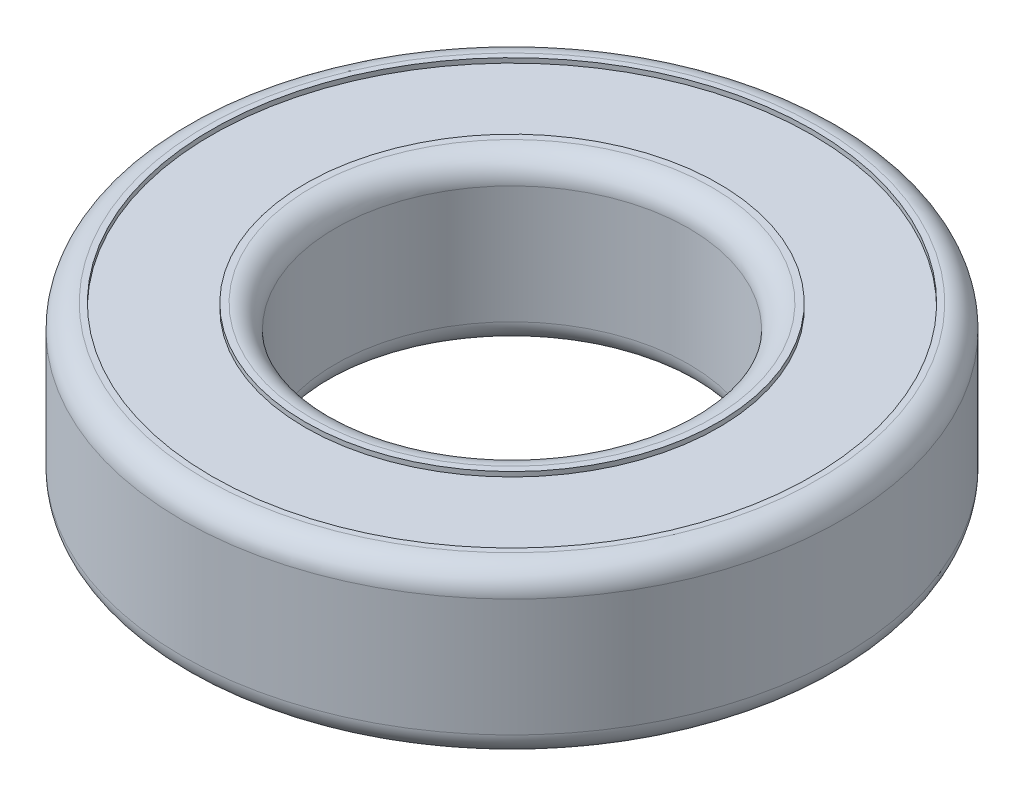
ISO-10303-21;
HEADER;
FILE_DESCRIPTION(('STEP AP214'),'2;1');
FILE_NAME('part.step','',(''),(''),'','','');
FILE_SCHEMA(('AUTOMOTIVE_DESIGN { 1 0 10303 214 1 1 1 1 }'));
ENDSEC;
DATA;
#1=APPLICATION_CONTEXT('core data for automotive mechanical design processes');
#2=APPLICATION_PROTOCOL_DEFINITION('international standard','automotive_design',2000,#1);
#3=PRODUCT_CONTEXT('',#1,'mechanical');
#4=PRODUCT('Part','Part','',(#3));
#5=PRODUCT_RELATED_PRODUCT_CATEGORY('part','',(#4));
#6=PRODUCT_DEFINITION_FORMATION('','',#4);
#7=PRODUCT_DEFINITION_CONTEXT('part definition',#1,'design');
#8=PRODUCT_DEFINITION('design','',#6,#7);
#9=PRODUCT_DEFINITION_SHAPE('','',#8);
#10=(LENGTH_UNIT() NAMED_UNIT(*) SI_UNIT(.MILLI.,.METRE.));
#11=(NAMED_UNIT(*) PLANE_ANGLE_UNIT() SI_UNIT($,.RADIAN.));
#12=(NAMED_UNIT(*) SI_UNIT($,.STERADIAN.) SOLID_ANGLE_UNIT());
#13=UNCERTAINTY_MEASURE_WITH_UNIT(LENGTH_MEASURE(1.E-05),#10,'distance_accuracy_value','');
#14=(GEOMETRIC_REPRESENTATION_CONTEXT(3) GLOBAL_UNCERTAINTY_ASSIGNED_CONTEXT((#13)) GLOBAL_UNIT_ASSIGNED_CONTEXT((#10,
#11,#12)) REPRESENTATION_CONTEXT('',''));
#15=CARTESIAN_POINT('',(0.,0.,0.));
#16=DIRECTION('',(0.,0.,1.));
#17=DIRECTION('',(1.,0.,0.));
#18=AXIS2_PLACEMENT_3D('',#15,#16,#17);
#19=CARTESIAN_POINT('',(-13.,-3.5,0.));
#20=DIRECTION('',(0.,1.,0.));
#21=DIRECTION('',(0.,0.,1.));
#22=AXIS2_PLACEMENT_3D('',#19,#20,#21);
#23=PLANE('',#22);
#24=CARTESIAN_POINT('',(0.,-3.5,0.));
#25=DIRECTION('',(0.,-1.,0.));
#26=DIRECTION('',(0.,0.,-1.));
#27=AXIS2_PLACEMENT_3D('',#24,#25,#26);
#28=CIRCLE('',#27,8.50000000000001);
#29=CARTESIAN_POINT('',(0.,-3.5,-8.50000000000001));
#30=VERTEX_POINT('',#29);
#31=EDGE_CURVE('E63',#30,#30,#28,.T.);
#32=ORIENTED_EDGE('',*,*,#31,.F.);
#33=EDGE_LOOP('',(#32));
#34=FACE_BOUND('',#33,.T.);
#35=CARTESIAN_POINT('',(0.,-3.5,0.));
#36=DIRECTION('',(0.,1.,0.));
#37=DIRECTION('',(0.,0.,1.));
#38=AXIS2_PLACEMENT_3D('',#35,#36,#37);
#39=CIRCLE('',#38,8.77808410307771);
#40=CARTESIAN_POINT('',(0.,-3.5,8.77808410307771));
#41=VERTEX_POINT('',#40);
#42=EDGE_CURVE('E85',#41,#41,#39,.T.);
#43=ORIENTED_EDGE('',*,*,#42,.F.);
#44=EDGE_LOOP('',(#43));
#45=FACE_BOUND('',#44,.T.);
#46=ADVANCED_FACE('F34',(#34,#45),#23,.F.);
#47=CARTESIAN_POINT('',(-13.,3.5,0.));
#48=DIRECTION('',(0.,-1.,0.));
#49=DIRECTION('',(0.,0.,-1.));
#50=AXIS2_PLACEMENT_3D('',#47,#48,#49);
#51=PLANE('',#50);
#52=CARTESIAN_POINT('',(0.,3.5,0.));
#53=DIRECTION('',(0.,-1.,0.));
#54=DIRECTION('',(0.,0.,-1.));
#55=AXIS2_PLACEMENT_3D('',#52,#53,#54);
#56=CIRCLE('',#55,8.50000000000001);
#57=CARTESIAN_POINT('',(0.,3.5,-8.50000000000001));
#58=VERTEX_POINT('',#57);
#59=EDGE_CURVE('E45',#58,#58,#56,.T.);
#60=ORIENTED_EDGE('',*,*,#59,.T.);
#61=EDGE_LOOP('',(#60));
#62=FACE_BOUND('',#61,.T.);
#63=CARTESIAN_POINT('',(0.,3.5,0.));
#64=DIRECTION('',(0.,1.,0.));
#65=DIRECTION('',(0.,0.,1.));
#66=AXIS2_PLACEMENT_3D('',#63,#64,#65);
#67=CIRCLE('',#66,8.77808410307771);
#68=CARTESIAN_POINT('',(0.,3.5,8.77808410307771));
#69=VERTEX_POINT('',#68);
#70=EDGE_CURVE('E73',#69,#69,#67,.T.);
#71=ORIENTED_EDGE('',*,*,#70,.T.);
#72=EDGE_LOOP('',(#71));
#73=FACE_BOUND('',#72,.T.);
#74=ADVANCED_FACE('F101',(#62,#73),#51,.F.);
#75=CARTESIAN_POINT('',(0.,-2.5,0.));
#76=DIRECTION('',(0.,-1.,0.));
#77=DIRECTION('',(0.,0.,-1.));
#78=AXIS2_PLACEMENT_3D('',#75,#76,#77);
#79=TOROIDAL_SURFACE('',#78,8.5,1.);
#80=CARTESIAN_POINT('',(0.,-2.49999999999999,0.));
#81=DIRECTION('',(0.,-1.,0.));
#82=DIRECTION('',(0.,0.,-1.));
#83=AXIS2_PLACEMENT_3D('',#80,#81,#82);
#84=CIRCLE('',#83,7.5);
#85=CARTESIAN_POINT('',(0.,-2.49999999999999,-7.5));
#86=VERTEX_POINT('',#85);
#87=EDGE_CURVE('E10',#86,#86,#84,.T.);
#88=ORIENTED_EDGE('',*,*,#87,.F.);
#89=EDGE_LOOP('',(#88));
#90=FACE_BOUND('',#89,.T.);
#91=ORIENTED_EDGE('',*,*,#31,.T.);
#92=EDGE_LOOP('',(#91));
#93=FACE_BOUND('',#92,.T.);
#94=ADVANCED_FACE('F36',(#90,#93),#79,.T.);
#95=CARTESIAN_POINT('',(0.,0.,0.));
#96=DIRECTION('',(0.,-1.,0.));
#97=DIRECTION('',(0.,0.,-1.));
#98=AXIS2_PLACEMENT_3D('',#95,#96,#97);
#99=CYLINDRICAL_SURFACE('',#98,7.5);
#100=CARTESIAN_POINT('',(0.,2.49999999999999,0.));
#101=DIRECTION('',(0.,-1.,0.));
#102=DIRECTION('',(0.,0.,-1.));
#103=AXIS2_PLACEMENT_3D('',#100,#101,#102);
#104=CIRCLE('',#103,7.5);
#105=CARTESIAN_POINT('',(0.,2.49999999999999,-7.5));
#106=VERTEX_POINT('',#105);
#107=EDGE_CURVE('E41',#106,#106,#104,.T.);
#108=ORIENTED_EDGE('',*,*,#107,.F.);
#109=EDGE_LOOP('',(#108));
#110=FACE_BOUND('',#109,.T.);
#111=ORIENTED_EDGE('',*,*,#87,.T.);
#112=EDGE_LOOP('',(#111));
#113=FACE_BOUND('',#112,.T.);
#114=ADVANCED_FACE('F149',(#110,#113),#99,.F.);
#115=CARTESIAN_POINT('',(0.,2.5,0.));
#116=DIRECTION('',(0.,-1.,0.));
#117=DIRECTION('',(0.,0.,-1.));
#118=AXIS2_PLACEMENT_3D('',#115,#116,#117);
#119=TOROIDAL_SURFACE('',#118,8.5,1.);
#120=ORIENTED_EDGE('',*,*,#59,.F.);
#121=EDGE_LOOP('',(#120));
#122=FACE_BOUND('',#121,.T.);
#123=ORIENTED_EDGE('',*,*,#107,.T.);
#124=EDGE_LOOP('',(#123));
#125=FACE_BOUND('',#124,.T.);
#126=ADVANCED_FACE('F144',(#122,#125),#119,.T.);
#127=CARTESIAN_POINT('',(0.,3.5,0.));
#128=DIRECTION('',(0.,1.,0.));
#129=DIRECTION('',(0.,0.,1.));
#130=AXIS2_PLACEMENT_3D('',#127,#128,#129);
#131=CIRCLE('',#130,12.7563824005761);
#132=CARTESIAN_POINT('',(0.,3.5,12.7563824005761));
#133=VERTEX_POINT('',#132);
#134=EDGE_CURVE('E67',#133,#133,#131,.T.);
#135=ORIENTED_EDGE('',*,*,#134,.F.);
#136=EDGE_LOOP('',(#135));
#137=FACE_BOUND('',#136,.T.);
#138=CARTESIAN_POINT('',(0.,3.5,0.));
#139=DIRECTION('',(0.,-1.,0.));
#140=DIRECTION('',(0.,0.,-1.));
#141=AXIS2_PLACEMENT_3D('',#138,#139,#140);
#142=CIRCLE('',#141,13.);
#143=CARTESIAN_POINT('',(0.,3.5,-13.));
#144=VERTEX_POINT('',#143);
#145=EDGE_CURVE('E49',#144,#144,#142,.T.);
#146=ORIENTED_EDGE('',*,*,#145,.F.);
#147=EDGE_LOOP('',(#146));
#148=FACE_BOUND('',#147,.T.);
#149=ADVANCED_FACE('F110',(#137,#148),#51,.F.);
#150=CARTESIAN_POINT('',(0.,2.5,0.));
#151=DIRECTION('',(0.,-1.,0.));
#152=DIRECTION('',(0.,0.,-1.));
#153=AXIS2_PLACEMENT_3D('',#150,#151,#152);
#154=TOROIDAL_SURFACE('',#153,13.,1.);
#155=CARTESIAN_POINT('',(0.,2.49999999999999,0.));
#156=DIRECTION('',(0.,-1.,0.));
#157=DIRECTION('',(0.,0.,-1.));
#158=AXIS2_PLACEMENT_3D('',#155,#156,#157);
#159=CIRCLE('',#158,14.);
#160=CARTESIAN_POINT('',(0.,2.49999999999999,-14.));
#161=VERTEX_POINT('',#160);
#162=EDGE_CURVE('E54',#161,#161,#159,.T.);
#163=ORIENTED_EDGE('',*,*,#162,.F.);
#164=EDGE_LOOP('',(#163));
#165=FACE_BOUND('',#164,.T.);
#166=ORIENTED_EDGE('',*,*,#145,.T.);
#167=EDGE_LOOP('',(#166));
#168=FACE_BOUND('',#167,.T.);
#169=ADVANCED_FACE('F134',(#165,#168),#154,.T.);
#170=CARTESIAN_POINT('',(0.,0.,0.));
#171=DIRECTION('',(0.,-1.,0.));
#172=DIRECTION('',(0.,0.,-1.));
#173=AXIS2_PLACEMENT_3D('',#170,#171,#172);
#174=CYLINDRICAL_SURFACE('',#173,14.);
#175=CARTESIAN_POINT('',(0.,-2.5,0.));
#176=DIRECTION('',(0.,-1.,0.));
#177=DIRECTION('',(0.,0.,-1.));
#178=AXIS2_PLACEMENT_3D('',#175,#176,#177);
#179=CIRCLE('',#178,14.);
#180=CARTESIAN_POINT('',(0.,-2.5,-14.));
#181=VERTEX_POINT('',#180);
#182=EDGE_CURVE('E57',#181,#181,#179,.T.);
#183=ORIENTED_EDGE('',*,*,#182,.F.);
#184=EDGE_LOOP('',(#183));
#185=FACE_BOUND('',#184,.T.);
#186=ORIENTED_EDGE('',*,*,#162,.T.);
#187=EDGE_LOOP('',(#186));
#188=FACE_BOUND('',#187,.T.);
#189=ADVANCED_FACE('F124',(#185,#188),#174,.T.);
#190=CARTESIAN_POINT('',(0.,-2.5,0.));
#191=DIRECTION('',(0.,-1.,0.));
#192=DIRECTION('',(0.,0.,-1.));
#193=AXIS2_PLACEMENT_3D('',#190,#191,#192);
#194=TOROIDAL_SURFACE('',#193,13.,1.);
#195=CARTESIAN_POINT('',(0.,-3.5,0.));
#196=DIRECTION('',(0.,-1.,0.));
#197=DIRECTION('',(0.,0.,-1.));
#198=AXIS2_PLACEMENT_3D('',#195,#196,#197);
#199=CIRCLE('',#198,13.);
#200=CARTESIAN_POINT('',(0.,-3.5,-13.));
#201=VERTEX_POINT('',#200);
#202=EDGE_CURVE('E60',#201,#201,#199,.T.);
#203=ORIENTED_EDGE('',*,*,#202,.F.);
#204=EDGE_LOOP('',(#203));
#205=FACE_BOUND('',#204,.T.);
#206=ORIENTED_EDGE('',*,*,#182,.T.);
#207=EDGE_LOOP('',(#206));
#208=FACE_BOUND('',#207,.T.);
#209=ADVANCED_FACE('F116',(#205,#208),#194,.T.);
#210=CARTESIAN_POINT('',(0.,-3.5,0.));
#211=DIRECTION('',(0.,1.,0.));
#212=DIRECTION('',(0.,0.,1.));
#213=AXIS2_PLACEMENT_3D('',#210,#211,#212);
#214=CIRCLE('',#213,12.7563824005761);
#215=CARTESIAN_POINT('',(0.,-3.5,12.7563824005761));
#216=VERTEX_POINT('',#215);
#217=EDGE_CURVE('E79',#216,#216,#214,.T.);
#218=ORIENTED_EDGE('',*,*,#217,.T.);
#219=EDGE_LOOP('',(#218));
#220=FACE_BOUND('',#219,.T.);
#221=ORIENTED_EDGE('',*,*,#202,.T.);
#222=EDGE_LOOP('',(#221));
#223=FACE_BOUND('',#222,.T.);
#224=ADVANCED_FACE('F104',(#220,#223),#23,.F.);
#225=CARTESIAN_POINT('',(0.,3.3,0.));
#226=DIRECTION('',(0.,1.,0.));
#227=DIRECTION('',(0.,0.,1.));
#228=AXIS2_PLACEMENT_3D('',#225,#226,#227);
#229=CYLINDRICAL_SURFACE('',#228,12.7563824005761);
#230=CARTESIAN_POINT('',(0.,3.3,0.));
#231=DIRECTION('',(0.,1.,0.));
#232=DIRECTION('',(0.,0.,1.));
#233=AXIS2_PLACEMENT_3D('',#230,#231,#232);
#234=CIRCLE('',#233,12.7563824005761);
#235=CARTESIAN_POINT('',(0.,3.3,12.7563824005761));
#236=VERTEX_POINT('',#235);
#237=EDGE_CURVE('E66',#236,#236,#234,.T.);
#238=ORIENTED_EDGE('',*,*,#237,.F.);
#239=EDGE_LOOP('',(#238));
#240=FACE_BOUND('',#239,.T.);
#241=ORIENTED_EDGE('',*,*,#134,.T.);
#242=EDGE_LOOP('',(#241));
#243=FACE_BOUND('',#242,.T.);
#244=ADVANCED_FACE('F115',(#240,#243),#229,.F.);
#245=CARTESIAN_POINT('',(0.,3.3,0.));
#246=DIRECTION('',(0.,1.,0.));
#247=DIRECTION('',(0.,0.,1.));
#248=AXIS2_PLACEMENT_3D('',#245,#246,#247);
#249=PLANE('',#248);
#250=CARTESIAN_POINT('',(0.,3.3,0.));
#251=DIRECTION('',(0.,1.,0.));
#252=DIRECTION('',(0.,0.,1.));
#253=AXIS2_PLACEMENT_3D('',#250,#251,#252);
#254=CIRCLE('',#253,8.77808410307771);
#255=CARTESIAN_POINT('',(0.,3.3,8.77808410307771));
#256=VERTEX_POINT('',#255);
#257=EDGE_CURVE('E70',#256,#256,#254,.T.);
#258=ORIENTED_EDGE('',*,*,#257,.F.);
#259=EDGE_LOOP('',(#258));
#260=FACE_BOUND('',#259,.T.);
#261=ORIENTED_EDGE('',*,*,#237,.T.);
#262=EDGE_LOOP('',(#261));
#263=FACE_BOUND('',#262,.T.);
#264=ADVANCED_FACE('F122',(#260,#263),#249,.T.);
#265=CARTESIAN_POINT('',(0.,3.3,0.));
#266=DIRECTION('',(0.,1.,0.));
#267=DIRECTION('',(0.,0.,1.));
#268=AXIS2_PLACEMENT_3D('',#265,#266,#267);
#269=CYLINDRICAL_SURFACE('',#268,8.77808410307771);
#270=ORIENTED_EDGE('',*,*,#257,.T.);
#271=EDGE_LOOP('',(#270));
#272=FACE_BOUND('',#271,.T.);
#273=ORIENTED_EDGE('',*,*,#70,.F.);
#274=EDGE_LOOP('',(#273));
#275=FACE_BOUND('',#274,.T.);
#276=ADVANCED_FACE('F192',(#272,#275),#269,.T.);
#277=CARTESIAN_POINT('',(0.,-3.3,0.));
#278=DIRECTION('',(0.,-1.,0.));
#279=DIRECTION('',(0.,0.,1.));
#280=AXIS2_PLACEMENT_3D('',#277,#278,#279);
#281=PLANE('',#280);
#282=CARTESIAN_POINT('',(0.,-3.3,0.));
#283=DIRECTION('',(0.,1.,0.));
#284=DIRECTION('',(0.,0.,1.));
#285=AXIS2_PLACEMENT_3D('',#282,#283,#284);
#286=CIRCLE('',#285,12.7563824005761);
#287=CARTESIAN_POINT('',(0.,-3.3,12.7563824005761));
#288=VERTEX_POINT('',#287);
#289=EDGE_CURVE('E76',#288,#288,#286,.T.);
#290=ORIENTED_EDGE('',*,*,#289,.F.);
#291=EDGE_LOOP('',(#290));
#292=FACE_BOUND('',#291,.T.);
#293=CARTESIAN_POINT('',(0.,-3.3,0.));
#294=DIRECTION('',(0.,1.,0.));
#295=DIRECTION('',(0.,0.,1.));
#296=AXIS2_PLACEMENT_3D('',#293,#294,#295);
#297=CIRCLE('',#296,8.77808410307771);
#298=CARTESIAN_POINT('',(0.,-3.3,8.77808410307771));
#299=VERTEX_POINT('',#298);
#300=EDGE_CURVE('E82',#299,#299,#297,.T.);
#301=ORIENTED_EDGE('',*,*,#300,.T.);
#302=EDGE_LOOP('',(#301));
#303=FACE_BOUND('',#302,.T.);
#304=ADVANCED_FACE('F91',(#292,#303),#281,.T.);
#305=CARTESIAN_POINT('',(0.,-3.3,0.));
#306=DIRECTION('',(0.,-1.,0.));
#307=DIRECTION('',(0.,0.,-1.));
#308=AXIS2_PLACEMENT_3D('',#305,#306,#307);
#309=CYLINDRICAL_SURFACE('',#308,12.7563824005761);
#310=ORIENTED_EDGE('',*,*,#289,.T.);
#311=EDGE_LOOP('',(#310));
#312=FACE_BOUND('',#311,.T.);
#313=ORIENTED_EDGE('',*,*,#217,.F.);
#314=EDGE_LOOP('',(#313));
#315=FACE_BOUND('',#314,.T.);
#316=ADVANCED_FACE('F96',(#312,#315),#309,.F.);
#317=CARTESIAN_POINT('',(0.,-3.3,0.));
#318=DIRECTION('',(0.,-1.,0.));
#319=DIRECTION('',(0.,0.,-1.));
#320=AXIS2_PLACEMENT_3D('',#317,#318,#319);
#321=CYLINDRICAL_SURFACE('',#320,8.77808410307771);
#322=ORIENTED_EDGE('',*,*,#300,.F.);
#323=EDGE_LOOP('',(#322));
#324=FACE_BOUND('',#323,.T.);
#325=ORIENTED_EDGE('',*,*,#42,.T.);
#326=EDGE_LOOP('',(#325));
#327=FACE_BOUND('',#326,.T.);
#328=ADVANCED_FACE('F93',(#324,#327),#321,.T.);
#329=CLOSED_SHELL('',(#46,#74,#94,#114,#126,#149,#169,#189,#209,#224,#244,#264,#276,#304,#316,#328));
#330=MANIFOLD_SOLID_BREP('B2',#329);
#331=ADVANCED_BREP_SHAPE_REPRESENTATION('',(#18,#330),#14);
#332=SHAPE_DEFINITION_REPRESENTATION(#9,#331);
ENDSEC;
END-ISO-10303-21;
